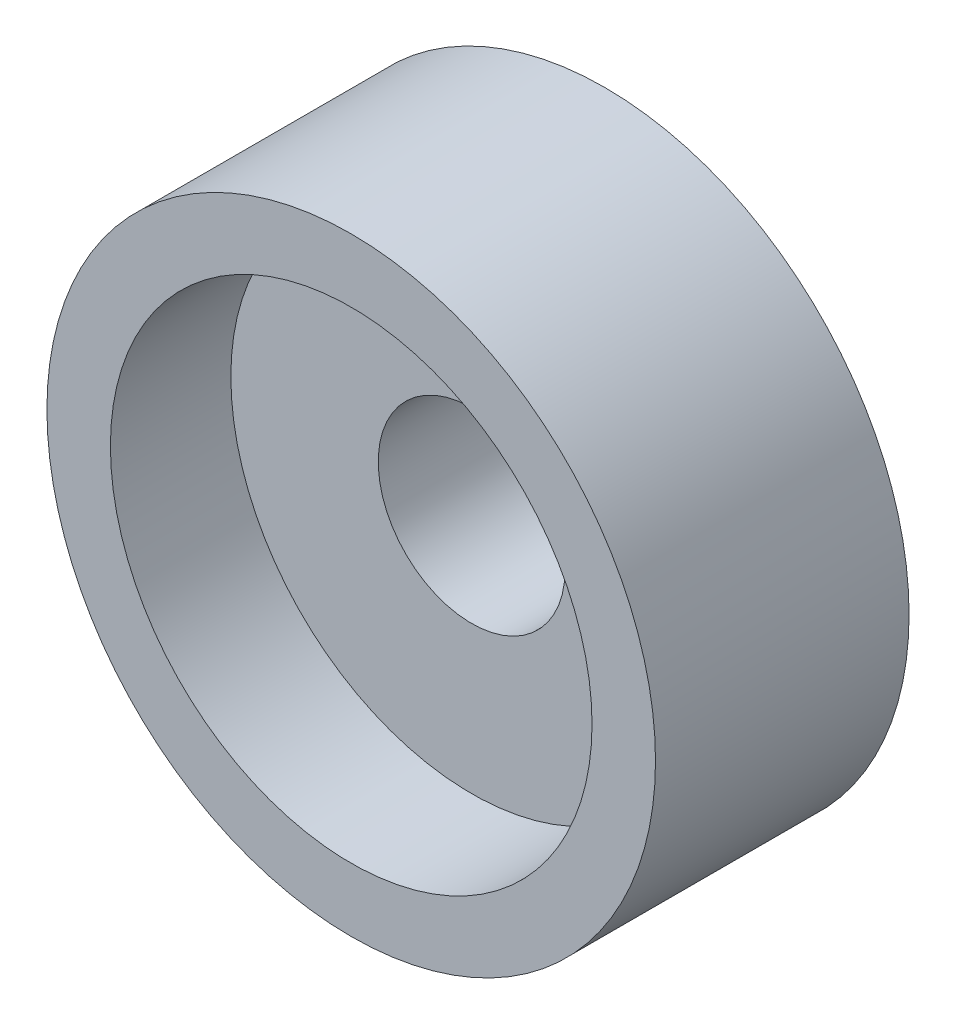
ISO-10303-21;
HEADER;
FILE_DESCRIPTION(('STEP AP214'),'2;1');
FILE_NAME('part.step','',(''),(''),'','','');
FILE_SCHEMA(('AUTOMOTIVE_DESIGN { 1 0 10303 214 1 1 1 1 }'));
ENDSEC;
DATA;
#1=APPLICATION_CONTEXT('core data for automotive mechanical design processes');
#2=APPLICATION_PROTOCOL_DEFINITION('international standard','automotive_design',2000,#1);
#3=PRODUCT_CONTEXT('',#1,'mechanical');
#4=PRODUCT('Part','Part','',(#3));
#5=PRODUCT_RELATED_PRODUCT_CATEGORY('part','',(#4));
#6=PRODUCT_DEFINITION_FORMATION('','',#4);
#7=PRODUCT_DEFINITION_CONTEXT('part definition',#1,'design');
#8=PRODUCT_DEFINITION('design','',#6,#7);
#9=PRODUCT_DEFINITION_SHAPE('','',#8);
#10=(LENGTH_UNIT() NAMED_UNIT(*) SI_UNIT(.MILLI.,.METRE.));
#11=(NAMED_UNIT(*) PLANE_ANGLE_UNIT() SI_UNIT($,.RADIAN.));
#12=(NAMED_UNIT(*) SI_UNIT($,.STERADIAN.) SOLID_ANGLE_UNIT());
#13=UNCERTAINTY_MEASURE_WITH_UNIT(LENGTH_MEASURE(1.E-05),#10,'distance_accuracy_value','');
#14=(GEOMETRIC_REPRESENTATION_CONTEXT(3) GLOBAL_UNCERTAINTY_ASSIGNED_CONTEXT((#13)) GLOBAL_UNIT_ASSIGNED_CONTEXT((#10,
#11,#12)) REPRESENTATION_CONTEXT('',''));
#15=CARTESIAN_POINT('',(0.,0.,0.));
#16=DIRECTION('',(0.,0.,1.));
#17=DIRECTION('',(1.,0.,0.));
#18=AXIS2_PLACEMENT_3D('',#15,#16,#17);
#19=CARTESIAN_POINT('',(0.,0.,20.));
#20=DIRECTION('',(0.,0.,-1.));
#21=DIRECTION('',(-1.,0.,0.));
#22=AXIS2_PLACEMENT_3D('',#19,#20,#21);
#23=CYLINDRICAL_SURFACE('',#22,24.);
#24=CARTESIAN_POINT('',(0.,0.,20.));
#25=DIRECTION('',(0.,0.,1.));
#26=DIRECTION('',(1.,0.,0.));
#27=AXIS2_PLACEMENT_3D('',#24,#25,#26);
#28=CIRCLE('',#27,24.);
#29=CARTESIAN_POINT('',(24.,0.,20.));
#30=VERTEX_POINT('',#29);
#31=EDGE_CURVE('E10',#30,#30,#28,.T.);
#32=ORIENTED_EDGE('',*,*,#31,.F.);
#33=EDGE_LOOP('',(#32));
#34=FACE_BOUND('',#33,.T.);
#35=CARTESIAN_POINT('',(0.,0.,0.));
#36=DIRECTION('',(0.,0.,1.));
#37=DIRECTION('',(1.,0.,0.));
#38=AXIS2_PLACEMENT_3D('',#35,#36,#37);
#39=CIRCLE('',#38,24.);
#40=CARTESIAN_POINT('',(24.,0.,0.));
#41=VERTEX_POINT('',#40);
#42=EDGE_CURVE('E32',#41,#41,#39,.T.);
#43=ORIENTED_EDGE('',*,*,#42,.T.);
#44=EDGE_LOOP('',(#43));
#45=FACE_BOUND('',#44,.T.);
#46=ADVANCED_FACE('F26',(#34,#45),#23,.T.);
#47=CARTESIAN_POINT('',(0.,0.,20.));
#48=DIRECTION('',(0.,0.,1.));
#49=DIRECTION('',(1.,0.,0.));
#50=AXIS2_PLACEMENT_3D('',#47,#48,#49);
#51=PLANE('',#50);
#52=CARTESIAN_POINT('',(0.,0.,20.));
#53=DIRECTION('',(0.,0.,1.));
#54=DIRECTION('',(1.,0.,0.));
#55=AXIS2_PLACEMENT_3D('',#52,#53,#54);
#56=CIRCLE('',#55,18.9935061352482);
#57=CARTESIAN_POINT('',(18.9935061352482,0.,20.));
#58=VERTEX_POINT('',#57);
#59=EDGE_CURVE('E40',#58,#58,#56,.T.);
#60=ORIENTED_EDGE('',*,*,#59,.F.);
#61=EDGE_LOOP('',(#60));
#62=FACE_BOUND('',#61,.T.);
#63=ORIENTED_EDGE('',*,*,#31,.T.);
#64=EDGE_LOOP('',(#63));
#65=FACE_BOUND('',#64,.T.);
#66=ADVANCED_FACE('F67',(#62,#65),#51,.T.);
#67=CARTESIAN_POINT('',(0.,0.,0.));
#68=DIRECTION('',(0.,0.,1.));
#69=DIRECTION('',(1.,0.,0.));
#70=AXIS2_PLACEMENT_3D('',#67,#68,#69);
#71=PLANE('',#70);
#72=CARTESIAN_POINT('',(0.,0.,0.));
#73=DIRECTION('',(0.,0.,1.));
#74=DIRECTION('',(1.,0.,0.));
#75=AXIS2_PLACEMENT_3D('',#72,#73,#74);
#76=CIRCLE('',#75,7.36750279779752);
#77=CARTESIAN_POINT('',(7.36750279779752,0.,0.));
#78=VERTEX_POINT('',#77);
#79=EDGE_CURVE('E45',#78,#78,#76,.T.);
#80=ORIENTED_EDGE('',*,*,#79,.T.);
#81=EDGE_LOOP('',(#80));
#82=FACE_BOUND('',#81,.T.);
#83=ORIENTED_EDGE('',*,*,#42,.F.);
#84=EDGE_LOOP('',(#83));
#85=FACE_BOUND('',#84,.T.);
#86=ADVANCED_FACE('F63',(#82,#85),#71,.F.);
#87=CARTESIAN_POINT('',(0.,0.,10.5));
#88=DIRECTION('',(0.,0.,1.));
#89=DIRECTION('',(1.,0.,0.));
#90=AXIS2_PLACEMENT_3D('',#87,#88,#89);
#91=CYLINDRICAL_SURFACE('',#90,18.9935061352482);
#92=CARTESIAN_POINT('',(0.,0.,10.5));
#93=DIRECTION('',(0.,0.,1.));
#94=DIRECTION('',(1.,0.,0.));
#95=AXIS2_PLACEMENT_3D('',#92,#93,#94);
#96=CIRCLE('',#95,18.9935061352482);
#97=CARTESIAN_POINT('',(18.9935061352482,0.,10.5));
#98=VERTEX_POINT('',#97);
#99=EDGE_CURVE('E36',#98,#98,#96,.T.);
#100=ORIENTED_EDGE('',*,*,#99,.F.);
#101=EDGE_LOOP('',(#100));
#102=FACE_BOUND('',#101,.T.);
#103=ORIENTED_EDGE('',*,*,#59,.T.);
#104=EDGE_LOOP('',(#103));
#105=FACE_BOUND('',#104,.T.);
#106=ADVANCED_FACE('F57',(#102,#105),#91,.F.);
#107=CARTESIAN_POINT('',(0.,0.,10.5));
#108=DIRECTION('',(0.,0.,1.));
#109=DIRECTION('',(1.,0.,0.));
#110=AXIS2_PLACEMENT_3D('',#107,#108,#109);
#111=PLANE('',#110);
#112=CARTESIAN_POINT('',(0.,0.,10.5));
#113=DIRECTION('',(0.,0.,1.));
#114=DIRECTION('',(1.,0.,0.));
#115=AXIS2_PLACEMENT_3D('',#112,#113,#114);
#116=CIRCLE('',#115,7.36750279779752);
#117=CARTESIAN_POINT('',(7.36750279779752,0.,10.5));
#118=VERTEX_POINT('',#117);
#119=EDGE_CURVE('E48',#118,#118,#116,.T.);
#120=ORIENTED_EDGE('',*,*,#119,.F.);
#121=EDGE_LOOP('',(#120));
#122=FACE_BOUND('',#121,.T.);
#123=ORIENTED_EDGE('',*,*,#99,.T.);
#124=EDGE_LOOP('',(#123));
#125=FACE_BOUND('',#124,.T.);
#126=ADVANCED_FACE('F54',(#122,#125),#111,.T.);
#127=CARTESIAN_POINT('',(0.,0.,0.));
#128=DIRECTION('',(0.,0.,1.));
#129=DIRECTION('',(1.,0.,0.));
#130=AXIS2_PLACEMENT_3D('',#127,#128,#129);
#131=CYLINDRICAL_SURFACE('',#130,7.36750279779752);
#132=CARTESIAN_POINT('',(7.36750279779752,0.,0.));
#133=CARTESIAN_POINT('',(7.36750279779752,0.,0.109375));
#134=CARTESIAN_POINT('',(7.36750279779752,0.,0.21875));
#135=CARTESIAN_POINT('',(7.36750279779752,0.,0.4375));
#136=CARTESIAN_POINT('',(7.36750279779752,0.,0.546875));
#137=CARTESIAN_POINT('',(7.36750279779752,0.,0.765625));
#138=CARTESIAN_POINT('',(7.36750279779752,0.,0.875));
#139=CARTESIAN_POINT('',(7.36750279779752,0.,1.09375));
#140=CARTESIAN_POINT('',(7.36750279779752,0.,1.203125));
#141=CARTESIAN_POINT('',(7.36750279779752,0.,1.421875));
#142=CARTESIAN_POINT('',(7.36750279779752,0.,1.53125));
#143=CARTESIAN_POINT('',(7.36750279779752,0.,1.75));
#144=CARTESIAN_POINT('',(7.36750279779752,0.,1.859375));
#145=CARTESIAN_POINT('',(7.36750279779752,0.,2.078125));
#146=CARTESIAN_POINT('',(7.36750279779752,0.,2.1875));
#147=CARTESIAN_POINT('',(7.36750279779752,0.,2.40625));
#148=CARTESIAN_POINT('',(7.36750279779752,0.,2.515625));
#149=CARTESIAN_POINT('',(7.36750279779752,0.,2.734375));
#150=CARTESIAN_POINT('',(7.36750279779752,0.,2.84375));
#151=CARTESIAN_POINT('',(7.36750279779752,0.,3.0625));
#152=CARTESIAN_POINT('',(7.36750279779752,0.,3.171875));
#153=CARTESIAN_POINT('',(7.36750279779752,0.,3.390625));
#154=CARTESIAN_POINT('',(7.36750279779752,0.,3.5));
#155=CARTESIAN_POINT('',(7.36750279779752,0.,3.71875));
#156=CARTESIAN_POINT('',(7.36750279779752,0.,3.828125));
#157=CARTESIAN_POINT('',(7.36750279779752,0.,4.046875));
#158=CARTESIAN_POINT('',(7.36750279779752,0.,4.15625));
#159=CARTESIAN_POINT('',(7.36750279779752,0.,4.375));
#160=CARTESIAN_POINT('',(7.36750279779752,0.,4.484375));
#161=CARTESIAN_POINT('',(7.36750279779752,0.,4.703125));
#162=CARTESIAN_POINT('',(7.36750279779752,0.,4.8125));
#163=CARTESIAN_POINT('',(7.36750279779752,0.,5.03125));
#164=CARTESIAN_POINT('',(7.36750279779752,0.,5.140625));
#165=CARTESIAN_POINT('',(7.36750279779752,0.,5.359375));
#166=CARTESIAN_POINT('',(7.36750279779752,0.,5.46875));
#167=CARTESIAN_POINT('',(7.36750279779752,0.,5.6875));
#168=CARTESIAN_POINT('',(7.36750279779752,0.,5.796875));
#169=CARTESIAN_POINT('',(7.36750279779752,0.,6.015625));
#170=CARTESIAN_POINT('',(7.36750279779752,0.,6.125));
#171=CARTESIAN_POINT('',(7.36750279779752,0.,6.34375));
#172=CARTESIAN_POINT('',(7.36750279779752,0.,6.453125));
#173=CARTESIAN_POINT('',(7.36750279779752,0.,6.671875));
#174=CARTESIAN_POINT('',(7.36750279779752,0.,6.78125));
#175=CARTESIAN_POINT('',(7.36750279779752,0.,7.));
#176=CARTESIAN_POINT('',(7.36750279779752,0.,7.109375));
#177=CARTESIAN_POINT('',(7.36750279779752,0.,7.328125));
#178=CARTESIAN_POINT('',(7.36750279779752,0.,7.4375));
#179=CARTESIAN_POINT('',(7.36750279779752,0.,7.65625));
#180=CARTESIAN_POINT('',(7.36750279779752,0.,7.765625));
#181=CARTESIAN_POINT('',(7.36750279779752,0.,7.984375));
#182=CARTESIAN_POINT('',(7.36750279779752,0.,8.09375));
#183=CARTESIAN_POINT('',(7.36750279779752,0.,8.3125));
#184=CARTESIAN_POINT('',(7.36750279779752,0.,8.421875));
#185=CARTESIAN_POINT('',(7.36750279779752,0.,8.640625));
#186=CARTESIAN_POINT('',(7.36750279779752,0.,8.75));
#187=CARTESIAN_POINT('',(7.36750279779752,0.,8.96875));
#188=CARTESIAN_POINT('',(7.36750279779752,0.,9.078125));
#189=CARTESIAN_POINT('',(7.36750279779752,0.,9.296875));
#190=CARTESIAN_POINT('',(7.36750279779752,0.,9.40625));
#191=CARTESIAN_POINT('',(7.36750279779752,0.,9.625));
#192=CARTESIAN_POINT('',(7.36750279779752,0.,9.734375));
#193=CARTESIAN_POINT('',(7.36750279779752,0.,9.953125));
#194=CARTESIAN_POINT('',(7.36750279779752,0.,10.0625));
#195=CARTESIAN_POINT('',(7.36750279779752,0.,10.28125));
#196=CARTESIAN_POINT('',(7.36750279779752,0.,10.390625));
#197=CARTESIAN_POINT('',(7.36750279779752,0.,10.5));
#198=B_SPLINE_CURVE_WITH_KNOTS('',3,(#132,#133,#134,#135,#136,#137,#138,#139,#140,#141,#142,
#143,#144,#145,#146,#147,#148,#149,#150,#151,#152,#153,#154,#155,#156,#157,#158,#159,#160,#161,
#162,#163,#164,#165,#166,#167,#168,#169,#170,#171,#172,#173,#174,#175,#176,#177,#178,#179,#180,
#181,#182,#183,#184,#185,#186,#187,#188,#189,#190,#191,#192,#193,#194,#195,#196,#197),
.UNSPECIFIED.,.F.,.F.,(4,2,2,2,2,2,2,2,2,2,2,2,2,2,2,2,2,2,2,2,2,2,2,2,2,2,2,2,2,2,2,2,4),(0.,
0.328125,0.65625,0.984375,1.3125,1.640625,1.96875,2.296875,2.625,2.953125,3.28125,3.609375,
3.9375,4.265625,4.59375,4.921875,5.25,5.578125,5.90625,6.234375,6.5625,6.890625,7.21875,
7.546875,7.875,8.203125,8.53125,8.859375,9.1875,9.515625,9.84375,10.171875,10.5),.UNSPECIFIED.);
#199=EDGE_CURVE('BSEAM52',#78,#118,#198,.T.);
#200=ORIENTED_EDGE('',*,*,#79,.F.);
#201=ORIENTED_EDGE('',*,*,#119,.T.);
#202=ORIENTED_EDGE('',*,*,#199,.T.);
#203=ORIENTED_EDGE('',*,*,#199,.F.);
#204=EDGE_LOOP('',(#200,#202,#201,#203));
#205=FACE_BOUND('',#204,.T.);
#206=ADVANCED_FACE('F52',(#205),#131,.F.);
#207=CLOSED_SHELL('',(#46,#66,#86,#106,#126,#206));
#208=MANIFOLD_SOLID_BREP('B2',#207);
#209=ADVANCED_BREP_SHAPE_REPRESENTATION('',(#18,#208),#14);
#210=SHAPE_DEFINITION_REPRESENTATION(#9,#209);
ENDSEC;
END-ISO-10303-21;
